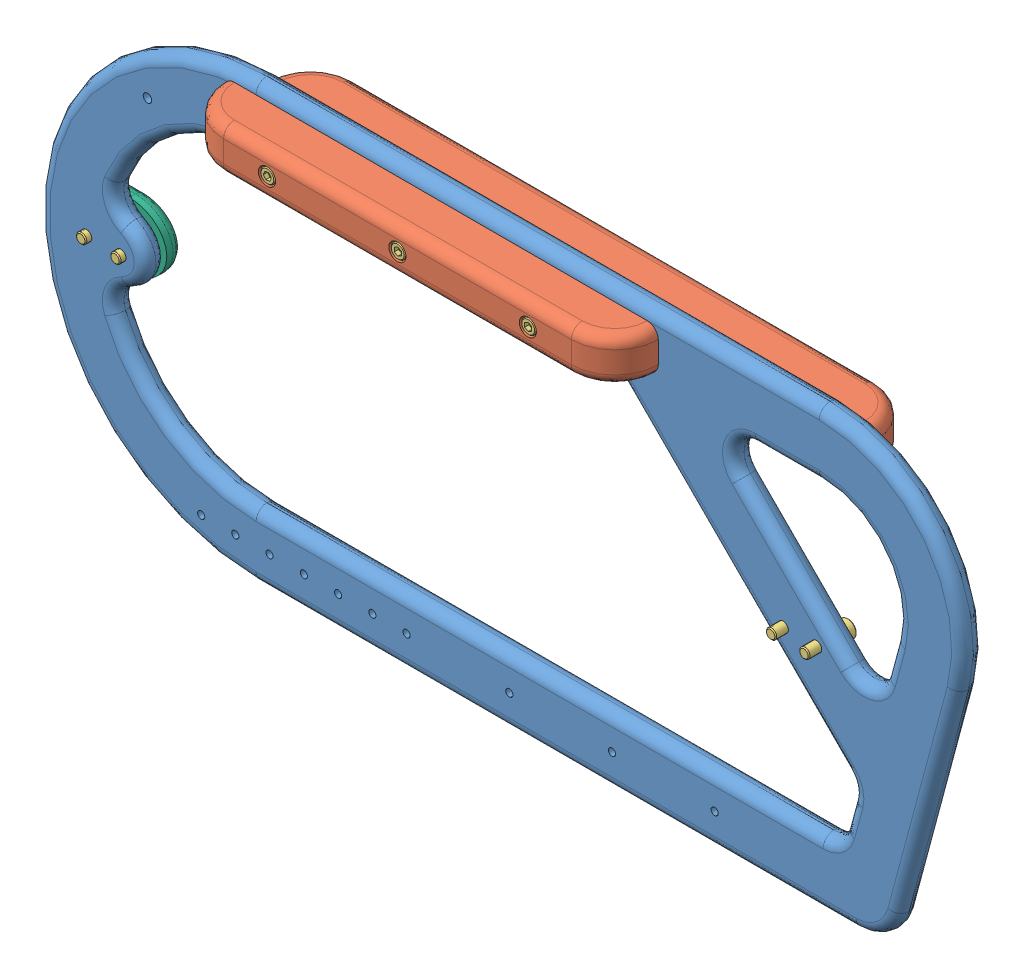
SolidWorks assembly Bumper Left Side.SLDASM, configuration Default (file format 5000). Lengths in mm.
Overall size (539.86 254 63.5).
14 component instances, 6 part files, 30 mates.
Components (placement in the parent):
- Bumper Side, Plastic REVb-1: Bumper Side, Plastic REVb.SLDPRT [Default] at (-219.3394 -148.508 -97.3732) x (-1 0 0) z (0 0 -1) size (539.86 254 12.7)
- Float-Plastic Frame-1: Float-Plastic Frame.SLDPRT [Default] at (-111.3593 -40.558 -97.3732) size (254 25.4 25.4)
- socket head cap screw_am-1: socket head cap screw_am.sldprt [B18.3.1M - 6 x 1.0 x 20 Hex SHCS -- 20NHX] at (108.1202 -143.208 -116.0732) x (0 0 1) z (-1 0 0) size (26 10 10)
- socket head cap screw_am-2: socket head cap screw_am.sldprt [B18.3.1M - 6 x 1.0 x 20 Hex SHCS -- 20NHX] at (88.6202 -143.208 -116.0732) x (0 0 1) z (-1 0 0) size (26 10 10)
- socket head cap screw_am-3: socket head cap screw_am.sldprt [B18.3.1M - 5 x 0.8 x 30 Hex SHCS -- 22NHX] at (-187.5593 -40.558 -72.1732) x (0 0 -1) z (0.794735 0.606957 0) size (35 8.5 8.5)
- socket head cap screw_am-4: socket head cap screw_am.sldprt [B18.3.1M - 5 x 0.8 x 30 Hex SHCS -- 22NHX] at (-111.3593 -40.558 -72.1732) x (0 0 -1) z (1 0 0) size (35 8.5 8.5)
- socket head cap screw_am-5: socket head cap screw_am.sldprt [B18.3.1M - 5 x 0.8 x 30 Hex SHCS -- 22NHX] at (-35.1593 -40.558 -72.1732) x (0 0 -1) z (1 0 0) size (35 8.5 8.5)
- Socket Button Head Cap Screw_AM-1: Socket Button Head Cap Screw_AM.SLDPRT [B18.3.4M - 5 x 0.8 x 16 SBHCS --N] at (-131.3994 -256.458 -119.1732) x (0 0 1) z (-0.983044 0.183371 0) size (18.75 9.5 9.5)
- Socket Button Head Cap Screw_AM-2: Socket Button Head Cap Screw_AM.SLDPRT [B18.3.4M - 5 x 0.8 x 16 SBHCS --N] at (-151.3994 -256.458 -119.1732) x (0 0 1) z (-1 0 0) size (18.75 9.5 9.5)
- Ballast, Bottom PBF-1: Ballast, Bottom PBF.SLDPRT [Default] at (-141.3994 -256.458 -113.2482) x (0 0 -1) z (1 0 0) size (6.35 25 40)
- Front Ballast-1: Front Ballast.SLDPRT [Default] at (-236.3798 -148.508 -110.0732) x (0 0 -1) z (-1 0 0) size (9.91 41.67 56.89)
- socket head cap screw_am-6: socket head cap screw_am.sldprt [B18.3.1M - 6 x 1.0 x 20 Hex SHCS -- 20NHX] at (-318.3798 -148.508 -119.9792) x (0 0 1) z (-0.129914 0.991525 0) size (26 10 10)
- socket head cap screw_am-7: socket head cap screw_am.sldprt [B18.3.1M - 6 x 1.0 x 20 Hex SHCS -- 20NHX] at (-298.3798 -148.508 -119.9792) x (0 0 1) z (-0.998503 -0.0547 0) size (26 10 10)
- Float-Plastic Frame-2: Float-Plastic Frame.SLDPRT [Outside Float] at (-47.8593 -40.558 -110.0732) x (1 0 0) z (0 0 -1) size (355.6 25.4 25.4)
Mates (geometry in assembly coordinates):
- Coincident1: coincident aligned: plane of Bumper Side, Plastic REVb-1 through (-219.3394 -148.508 -97.3732) normal (0 0 1); plane of Float-Plastic Frame-1 through (-111.3593 -40.558 -97.3732) normal (0 0 1)
- Concentric1: concentric aligned: cylinder of Float-Plastic Frame-1 through (-187.5593 -40.558 -71.9732) axis (0 0 1) radius 2.85; cylinder of socket head cap screw_am-3 through (-187.5593 -40.558 -40.4232) axis (0 0 1) radius 2.5
- Coincident2: coincident anti-aligned: plane of Float-Plastic Frame-1 through (-184.7093 -40.558 -77.1732) normal (0 0 1); plane of socket head cap screw_am-3 through (-190.1388 -37.1804 -77.1732) normal (0 0 -1)
- Concentric2: concentric aligned: cylinder of Float-Plastic Frame-1 through (-111.3593 -40.558 -71.9732) axis (0 0 1) radius 2.85; cylinder of socket head cap screw_am-4 through (-111.3593 -40.558 -40.4232) axis (0 0 1) radius 2.5
- Coincident3: coincident anti-aligned: plane of Float-Plastic Frame-1 through (-108.5093 -40.558 -77.1732) normal (0 0 1); plane of socket head cap screw_am-4 through (-111.3593 -36.308 -77.1732) normal (0 0 -1)
- Concentric3: concentric aligned: cylinder of Float-Plastic Frame-1 through (-35.1593 -40.558 -71.9732) axis (0 0 1) radius 2.85; cylinder of socket head cap screw_am-5 through (-35.1593 -40.558 -40.4232) axis (0 0 1) radius 2.5
- Coincident4: coincident anti-aligned: plane of Float-Plastic Frame-1 through (-32.3093 -40.558 -77.1732) normal (0 0 1); plane of socket head cap screw_am-5 through (-35.1593 -36.308 -77.1732) normal (0 0 -1)
- Concentric4: concentric aligned: cylinder of Bumper Side, Plastic REVb-1 through (108.1202 -143.208 -110.0732) axis (0 0 -1) radius 3.05; cylinder of socket head cap screw_am-1 through (108.1202 -143.208 -147.8232) axis (0 0 -1) radius 3
- Coincident5: coincident anti-aligned: plane of Bumper Side, Plastic REVb-1 through (-219.3394 -148.508 -110.0732) normal (0 0 -1); plane of socket head cap screw_am-1 through (108.1202 -138.208 -110.0732) normal (0 0 1)
- Coincident6: coincident anti-aligned: plane of Bumper Side, Plastic REVb-1 through (-219.3394 -148.508 -110.0732) normal (0 0 -1); plane of socket head cap screw_am-2 through (88.6202 -138.208 -110.0732) normal (0 0 1)
- Concentric5: concentric aligned: circle of Bumper Side, Plastic REVb-1; cylinder of socket head cap screw_am-2 through (88.6202 -143.208 -147.8232) axis (0 0 -1) radius 3
- Coincident7: coincident anti-aligned: plane of Bumper Side, Plastic REVb-1 through (-219.3394 -148.508 -110.0732) normal (0 0 -1); plane of Ballast, Bottom PBF-1 through (-121.3994 -268.958 -110.0732) normal (0 0 1)
- Concentric6: concentric anti-aligned: cylinder of Ballast, Bottom PBF-1 through (-131.3994 -256.458 -110.0732) axis (0 0 1) radius 2.55; cylinder of Socket Button Head Cap Screw_AM-1 through (-131.3994 -256.458 -119.1732) axis (0 0 -1) radius 2.5
- Coincident8: coincident anti-aligned: plane of Ballast, Bottom PBF-1 through (-121.3994 -268.958 -116.4232) normal (0 0 -1); plane of Socket Button Head Cap Screw_AM-1 through (-130.941 -254.0004 -116.4232) normal (0 0 1)
- Concentric7: concentric anti-aligned: cylinder of Ballast, Bottom PBF-1 through (-151.3994 -256.458 -110.0732) axis (0 0 1) radius 2.55; cylinder of Socket Button Head Cap Screw_AM-2 through (-151.3994 -256.458 -119.1732) axis (0 0 -1) radius 2.5
- Coincident9: coincident anti-aligned: plane of Ballast, Bottom PBF-1 through (-121.3994 -268.958 -116.4232) normal (0 0 -1); plane of Socket Button Head Cap Screw_AM-2 through (-151.3994 -253.958 -116.4232) normal (0 0 1)
- Coincident11: coincident anti-aligned: plane of Bumper Side, Plastic REVb-1 through (-219.3394 -148.508 -110.0732) normal (0 0 -1); plane of Front Ballast-1 through (-306.1853 -148.508 -110.0732) normal (0 0 1)
- Concentric9: concentric aligned: cylinder of Bumper Side, Plastic REVb-1 through (-298.3798 -148.508 -110.0732) axis (0 0 -1) radius 3.05; cylinder of Front Ballast-1 through (-298.3798 -148.508 -119.9792) axis (0 0 -1) radius 5.5
- Concentric10: concentric aligned: cylinder of Bumper Side, Plastic REVb-1 through (-318.3798 -148.508 -110.0732) axis (0 0 -1) radius 3.05; cylinder of Front Ballast-1 through (-318.3798 -148.508 -119.9792) axis (0 0 -1) radius 3.3
- Coincident12: coincident anti-aligned: plane of Bumper Side, Plastic REVb-1 through (-219.3394 -148.508 -110.0732) normal (0 0 -1); plane of Front Ballast-1 through (-306.1853 -148.508 -110.0732) normal (0 0 1)
- Concentric12: concentric anti-aligned: cylinder of Bumper Side, Plastic REVb-1 through (-131.3994 -256.458 -110.0732) axis (0 0 1) radius 2.1; cylinder of Socket Button Head Cap Screw_AM-1 through (-131.3994 -256.458 -119.1732) axis (0 0 -1) radius 2.5
- Concentric13: concentric anti-aligned: cylinder of socket head cap screw_am-5 through (-35.1593 -40.558 -40.4232) axis (0 0 1) radius 2.5; cylinder of Bumper Side, Plastic REVb-1 through (-35.1593 -40.558 -110.0732) axis (0 0 -1) radius 2.1
- Concentric16: concentric aligned: cylinder of Front Ballast-1 through (-318.3798 -148.508 -119.9792) axis (0 0 -1) radius 5.5; cylinder of socket head cap screw_am-6 through (-318.3798 -148.508 -151.7292) axis (0 0 -1) radius 5
- Coincident15: coincident anti-aligned: plane of Front Ballast-1 through (-318.3798 -151.808 -113.9792) normal (0 0 -1); plane of socket head cap screw_am-6 through (-313.4222 -147.8584 -113.9792) normal (0 0 1)
- Concentric17: concentric aligned: cylinder of Front Ballast-1 through (-298.3798 -148.508 -119.9792) axis (0 0 -1) radius 5.5; cylinder of socket head cap screw_am-7 through (-298.3798 -148.508 -151.7292) axis (0 0 -1) radius 5
- Coincident16: coincident anti-aligned: plane of Front Ballast-1 through (-298.3798 -151.808 -113.9792) normal (0 0 -1); plane of socket head cap screw_am-7 through (-298.6533 -143.5155 -113.9792) normal (0 0 1)
- Concentric19: concentric aligned: cylinder of Bumper Side, Plastic REVb-1 through (-187.5593 -40.558 -110.0732) axis (0 0 -1) radius 2.1; cylinder of Float-Plastic Frame-2 through (-187.5593 -40.558 -135.4732) axis (0 0 -1) radius 5
- Coincident17: coincident anti-aligned: plane of Bumper Side, Plastic REVb-1 through (-219.3394 -148.508 -110.0732) normal (0 0 -1); plane of Float-Plastic Frame-2 through (-225.6593 -53.258 -110.0732) normal (0 0 1)
- Coincident18: coincident aligned: plane of Float-Plastic Frame-1 through (-238.3593 -27.858 -71.9732) normal (0 1 0); plane of Float-Plastic Frame-2 through (-225.6593 -27.858 -135.4732) normal (0 1 0)
- Concentric20: concentric anti-aligned: cylinder of Bumper Side, Plastic REVb-1 through (-151.3994 -256.458 -110.0732) axis (0 0 1) radius 2.1; cylinder of Socket Button Head Cap Screw_AM-2 through (-151.3994 -256.458 -119.1732) axis (0 0 -1) radius 2.5
